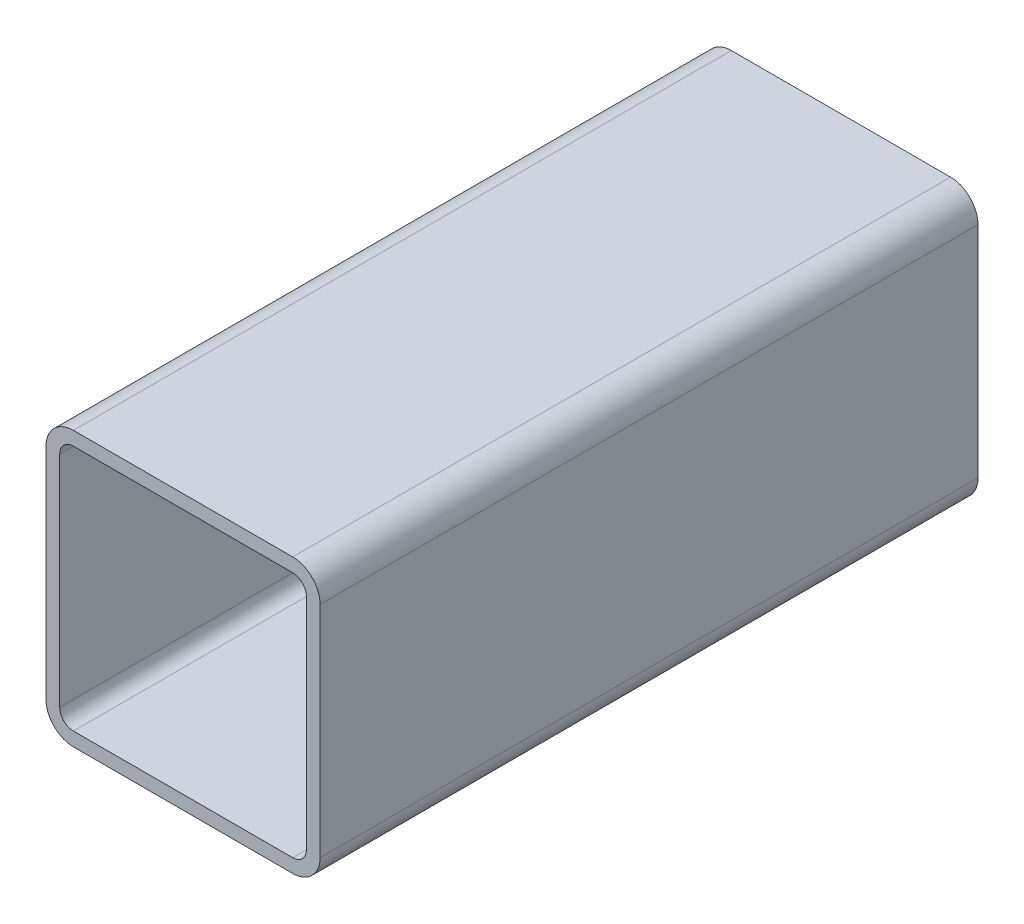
ISO-10303-21;
HEADER;
FILE_DESCRIPTION(('STEP AP214'),'2;1');
FILE_NAME('part.step','',(''),(''),'','','');
FILE_SCHEMA(('AUTOMOTIVE_DESIGN { 1 0 10303 214 1 1 1 1 }'));
ENDSEC;
DATA;
#1=APPLICATION_CONTEXT('core data for automotive mechanical design processes');
#2=APPLICATION_PROTOCOL_DEFINITION('international standard','automotive_design',2000,#1);
#3=PRODUCT_CONTEXT('',#1,'mechanical');
#4=PRODUCT('Part','Part','',(#3));
#5=PRODUCT_RELATED_PRODUCT_CATEGORY('part','',(#4));
#6=PRODUCT_DEFINITION_FORMATION('','',#4);
#7=PRODUCT_DEFINITION_CONTEXT('part definition',#1,'design');
#8=PRODUCT_DEFINITION('design','',#6,#7);
#9=PRODUCT_DEFINITION_SHAPE('','',#8);
#10=(LENGTH_UNIT() NAMED_UNIT(*) SI_UNIT(.MILLI.,.METRE.));
#11=(NAMED_UNIT(*) PLANE_ANGLE_UNIT() SI_UNIT($,.RADIAN.));
#12=(NAMED_UNIT(*) SI_UNIT($,.STERADIAN.) SOLID_ANGLE_UNIT());
#13=UNCERTAINTY_MEASURE_WITH_UNIT(LENGTH_MEASURE(1.E-05),#10,'distance_accuracy_value','');
#14=(GEOMETRIC_REPRESENTATION_CONTEXT(3) GLOBAL_UNCERTAINTY_ASSIGNED_CONTEXT((#13)) GLOBAL_UNIT_ASSIGNED_CONTEXT((#10,
#11,#12)) REPRESENTATION_CONTEXT('',''));
#15=CARTESIAN_POINT('',(0.,0.,0.));
#16=DIRECTION('',(0.,0.,1.));
#17=DIRECTION('',(1.,0.,0.));
#18=AXIS2_PLACEMENT_3D('',#15,#16,#17);
#19=CARTESIAN_POINT('',(13.5612396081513,116.33485662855,304.8));
#20=DIRECTION('',(0.,0.,1.));
#21=DIRECTION('',(1.,0.,0.));
#22=AXIS2_PLACEMENT_3D('',#19,#20,#21);
#23=PLANE('',#22);
#24=CARTESIAN_POINT('',(13.5612396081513,116.33485662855,304.8));
#25=DIRECTION('',(0.,0.,1.));
#26=DIRECTION('',(1.,0.,0.));
#27=AXIS2_PLACEMENT_3D('',#24,#25,#26);
#28=CIRCLE('',#27,12.7);
#29=CARTESIAN_POINT('',(13.5612396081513,129.03485662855,304.8));
#30=VERTEX_POINT('',#29);
#31=CARTESIAN_POINT('',(0.8612396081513,116.33485662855,304.8));
#32=VERTEX_POINT('',#31);
#33=EDGE_CURVE('E211',#30,#32,#28,.T.);
#34=ORIENTED_EDGE('',*,*,#33,.T.);
#35=DIRECTION('',(0.,-1.,0.));
#36=VECTOR('',#35,1.);
#37=CARTESIAN_POINT('',(0.8612396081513,14.73485662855,304.8));
#38=LINE('',#37,#36);
#39=CARTESIAN_POINT('',(0.8612396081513,14.73485662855,304.8));
#40=VERTEX_POINT('',#39);
#41=EDGE_CURVE('E214',#32,#40,#38,.T.);
#42=ORIENTED_EDGE('',*,*,#41,.T.);
#43=CARTESIAN_POINT('',(13.5612396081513,14.73485662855,304.8));
#44=DIRECTION('',(0.,0.,1.));
#45=DIRECTION('',(1.,0.,0.));
#46=AXIS2_PLACEMENT_3D('',#43,#44,#45);
#47=CIRCLE('',#46,12.7);
#48=CARTESIAN_POINT('',(13.5612396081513,2.03485662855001,304.8));
#49=VERTEX_POINT('',#48);
#50=EDGE_CURVE('E217',#40,#49,#47,.T.);
#51=ORIENTED_EDGE('',*,*,#50,.T.);
#52=DIRECTION('',(1.,0.,0.));
#53=VECTOR('',#52,1.);
#54=CARTESIAN_POINT('',(115.161239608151,2.03485662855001,304.8));
#55=LINE('',#54,#53);
#56=CARTESIAN_POINT('',(115.161239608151,2.03485662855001,304.8));
#57=VERTEX_POINT('',#56);
#58=EDGE_CURVE('E219',#49,#57,#55,.T.);
#59=ORIENTED_EDGE('',*,*,#58,.T.);
#60=CARTESIAN_POINT('',(115.161239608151,14.73485662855,304.8));
#61=DIRECTION('',(0.,0.,1.));
#62=DIRECTION('',(1.,0.,0.));
#63=AXIS2_PLACEMENT_3D('',#60,#61,#62);
#64=CIRCLE('',#63,12.7);
#65=CARTESIAN_POINT('',(127.861239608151,14.73485662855,304.8));
#66=VERTEX_POINT('',#65);
#67=EDGE_CURVE('E221',#57,#66,#64,.T.);
#68=ORIENTED_EDGE('',*,*,#67,.T.);
#69=DIRECTION('',(0.,1.,0.));
#70=VECTOR('',#69,1.);
#71=CARTESIAN_POINT('',(127.861239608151,116.33485662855,304.8));
#72=LINE('',#71,#70);
#73=CARTESIAN_POINT('',(127.861239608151,116.33485662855,304.8));
#74=VERTEX_POINT('',#73);
#75=EDGE_CURVE('E223',#66,#74,#72,.T.);
#76=ORIENTED_EDGE('',*,*,#75,.T.);
#77=CARTESIAN_POINT('',(115.161239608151,116.33485662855,304.8));
#78=DIRECTION('',(0.,0.,1.));
#79=DIRECTION('',(1.,0.,0.));
#80=AXIS2_PLACEMENT_3D('',#77,#78,#79);
#81=CIRCLE('',#80,12.7);
#82=CARTESIAN_POINT('',(115.161239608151,129.03485662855,304.8));
#83=VERTEX_POINT('',#82);
#84=EDGE_CURVE('E225',#74,#83,#81,.T.);
#85=ORIENTED_EDGE('',*,*,#84,.T.);
#86=DIRECTION('',(-1.,0.,0.));
#87=VECTOR('',#86,1.);
#88=CARTESIAN_POINT('',(13.5612396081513,129.03485662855,304.8));
#89=LINE('',#88,#87);
#90=EDGE_CURVE('E227',#83,#30,#89,.T.);
#91=ORIENTED_EDGE('',*,*,#90,.T.);
#92=EDGE_LOOP('',(#34,#42,#51,#59,#68,#76,#85,#91));
#93=FACE_BOUND('',#92,.T.);
#94=DIRECTION('',(0.,-1.,0.));
#95=VECTOR('',#94,1.);
#96=CARTESIAN_POINT('',(7.2112396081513,14.73485662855,304.8));
#97=LINE('',#96,#95);
#98=CARTESIAN_POINT('',(7.2112396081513,116.33485662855,304.8));
#99=VERTEX_POINT('',#98);
#100=CARTESIAN_POINT('',(7.2112396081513,14.73485662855,304.8));
#101=VERTEX_POINT('',#100);
#102=EDGE_CURVE('E154',#99,#101,#97,.T.);
#103=ORIENTED_EDGE('',*,*,#102,.F.);
#104=CARTESIAN_POINT('',(13.5612396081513,116.33485662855,304.8));
#105=DIRECTION('',(0.,0.,1.));
#106=DIRECTION('',(1.,0.,0.));
#107=AXIS2_PLACEMENT_3D('',#104,#105,#106);
#108=CIRCLE('',#107,6.35000000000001);
#109=CARTESIAN_POINT('',(13.5612396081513,122.68485662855,304.8));
#110=VERTEX_POINT('',#109);
#111=EDGE_CURVE('E146',#110,#99,#108,.T.);
#112=ORIENTED_EDGE('',*,*,#111,.F.);
#113=DIRECTION('',(-1.,0.,0.));
#114=VECTOR('',#113,1.);
#115=CARTESIAN_POINT('',(13.5612396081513,122.68485662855,304.8));
#116=LINE('',#115,#114);
#117=CARTESIAN_POINT('',(115.161239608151,122.68485662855,304.8));
#118=VERTEX_POINT('',#117);
#119=EDGE_CURVE('E179',#118,#110,#116,.T.);
#120=ORIENTED_EDGE('',*,*,#119,.F.);
#121=CARTESIAN_POINT('',(115.161239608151,116.33485662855,304.8));
#122=DIRECTION('',(0.,0.,1.));
#123=DIRECTION('',(1.,0.,0.));
#124=AXIS2_PLACEMENT_3D('',#121,#122,#123);
#125=CIRCLE('',#124,6.35000000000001);
#126=CARTESIAN_POINT('',(121.511239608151,116.33485662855,304.8));
#127=VERTEX_POINT('',#126);
#128=EDGE_CURVE('E177',#127,#118,#125,.T.);
#129=ORIENTED_EDGE('',*,*,#128,.F.);
#130=DIRECTION('',(0.,1.,0.));
#131=VECTOR('',#130,1.);
#132=CARTESIAN_POINT('',(121.511239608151,116.33485662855,304.8));
#133=LINE('',#132,#131);
#134=CARTESIAN_POINT('',(121.511239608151,14.73485662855,304.8));
#135=VERTEX_POINT('',#134);
#136=EDGE_CURVE('E175',#135,#127,#133,.T.);
#137=ORIENTED_EDGE('',*,*,#136,.F.);
#138=CARTESIAN_POINT('',(115.161239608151,14.73485662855,304.8));
#139=DIRECTION('',(0.,0.,1.));
#140=DIRECTION('',(1.,0.,0.));
#141=AXIS2_PLACEMENT_3D('',#138,#139,#140);
#142=CIRCLE('',#141,6.35000000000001);
#143=CARTESIAN_POINT('',(115.161239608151,8.38485662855,304.8));
#144=VERTEX_POINT('',#143);
#145=EDGE_CURVE('E173',#144,#135,#142,.T.);
#146=ORIENTED_EDGE('',*,*,#145,.F.);
#147=DIRECTION('',(1.,0.,0.));
#148=VECTOR('',#147,1.);
#149=CARTESIAN_POINT('',(115.161239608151,8.38485662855,304.8));
#150=LINE('',#149,#148);
#151=CARTESIAN_POINT('',(13.5612396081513,8.38485662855,304.8));
#152=VERTEX_POINT('',#151);
#153=EDGE_CURVE('E169',#152,#144,#150,.T.);
#154=ORIENTED_EDGE('',*,*,#153,.F.);
#155=CARTESIAN_POINT('',(13.5612396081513,14.73485662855,304.8));
#156=DIRECTION('',(0.,0.,1.));
#157=DIRECTION('',(1.,0.,0.));
#158=AXIS2_PLACEMENT_3D('',#155,#156,#157);
#159=CIRCLE('',#158,6.35);
#160=EDGE_CURVE('E167',#101,#152,#159,.T.);
#161=ORIENTED_EDGE('',*,*,#160,.F.);
#162=EDGE_LOOP('',(#103,#112,#120,#129,#137,#146,#154,#161));
#163=FACE_BOUND('',#162,.T.);
#164=ADVANCED_FACE('F33',(#93,#163),#23,.T.);
#165=CARTESIAN_POINT('',(13.5612396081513,116.33485662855,0.));
#166=DIRECTION('',(0.,0.,1.));
#167=DIRECTION('',(1.,0.,0.));
#168=AXIS2_PLACEMENT_3D('',#165,#166,#167);
#169=PLANE('',#168);
#170=CARTESIAN_POINT('',(13.5612396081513,116.33485662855,0.));
#171=DIRECTION('',(0.,0.,1.));
#172=DIRECTION('',(1.,0.,0.));
#173=AXIS2_PLACEMENT_3D('',#170,#171,#172);
#174=CIRCLE('',#173,12.7);
#175=CARTESIAN_POINT('',(13.5612396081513,129.03485662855,0.));
#176=VERTEX_POINT('',#175);
#177=CARTESIAN_POINT('',(0.8612396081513,116.33485662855,0.));
#178=VERTEX_POINT('',#177);
#179=EDGE_CURVE('E162',#176,#178,#174,.T.);
#180=ORIENTED_EDGE('',*,*,#179,.F.);
#181=DIRECTION('',(-1.,0.,0.));
#182=VECTOR('',#181,1.);
#183=CARTESIAN_POINT('',(13.5612396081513,129.03485662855,0.));
#184=LINE('',#183,#182);
#185=CARTESIAN_POINT('',(115.161239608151,129.03485662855,0.));
#186=VERTEX_POINT('',#185);
#187=EDGE_CURVE('E215',#186,#176,#184,.T.);
#188=ORIENTED_EDGE('',*,*,#187,.F.);
#189=CARTESIAN_POINT('',(115.161239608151,116.33485662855,0.));
#190=DIRECTION('',(0.,0.,1.));
#191=DIRECTION('',(1.,0.,0.));
#192=AXIS2_PLACEMENT_3D('',#189,#190,#191);
#193=CIRCLE('',#192,12.7);
#194=CARTESIAN_POINT('',(127.861239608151,116.33485662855,0.));
#195=VERTEX_POINT('',#194);
#196=EDGE_CURVE('E242',#195,#186,#193,.T.);
#197=ORIENTED_EDGE('',*,*,#196,.F.);
#198=DIRECTION('',(0.,1.,0.));
#199=VECTOR('',#198,1.);
#200=CARTESIAN_POINT('',(127.861239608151,116.33485662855,0.));
#201=LINE('',#200,#199);
#202=CARTESIAN_POINT('',(127.861239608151,14.73485662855,0.));
#203=VERTEX_POINT('',#202);
#204=EDGE_CURVE('E240',#203,#195,#201,.T.);
#205=ORIENTED_EDGE('',*,*,#204,.F.);
#206=CARTESIAN_POINT('',(115.161239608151,14.73485662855,0.));
#207=DIRECTION('',(0.,0.,1.));
#208=DIRECTION('',(1.,0.,0.));
#209=AXIS2_PLACEMENT_3D('',#206,#207,#208);
#210=CIRCLE('',#209,12.7);
#211=CARTESIAN_POINT('',(115.161239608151,2.03485662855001,0.));
#212=VERTEX_POINT('',#211);
#213=EDGE_CURVE('E238',#212,#203,#210,.T.);
#214=ORIENTED_EDGE('',*,*,#213,.F.);
#215=DIRECTION('',(1.,0.,0.));
#216=VECTOR('',#215,1.);
#217=CARTESIAN_POINT('',(115.161239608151,2.03485662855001,0.));
#218=LINE('',#217,#216);
#219=CARTESIAN_POINT('',(13.5612396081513,2.03485662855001,0.));
#220=VERTEX_POINT('',#219);
#221=EDGE_CURVE('E236',#220,#212,#218,.T.);
#222=ORIENTED_EDGE('',*,*,#221,.F.);
#223=CARTESIAN_POINT('',(13.5612396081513,14.73485662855,0.));
#224=DIRECTION('',(0.,0.,1.));
#225=DIRECTION('',(1.,0.,0.));
#226=AXIS2_PLACEMENT_3D('',#223,#224,#225);
#227=CIRCLE('',#226,12.7);
#228=CARTESIAN_POINT('',(0.8612396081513,14.73485662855,0.));
#229=VERTEX_POINT('',#228);
#230=EDGE_CURVE('E234',#229,#220,#227,.T.);
#231=ORIENTED_EDGE('',*,*,#230,.F.);
#232=DIRECTION('',(0.,-1.,0.));
#233=VECTOR('',#232,1.);
#234=CARTESIAN_POINT('',(0.8612396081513,14.73485662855,0.));
#235=LINE('',#234,#233);
#236=EDGE_CURVE('E232',#178,#229,#235,.T.);
#237=ORIENTED_EDGE('',*,*,#236,.F.);
#238=EDGE_LOOP('',(#180,#188,#197,#205,#214,#222,#231,#237));
#239=FACE_BOUND('',#238,.T.);
#240=CARTESIAN_POINT('',(13.5612396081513,116.33485662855,0.));
#241=DIRECTION('',(0.,0.,1.));
#242=DIRECTION('',(1.,0.,0.));
#243=AXIS2_PLACEMENT_3D('',#240,#241,#242);
#244=CIRCLE('',#243,6.35000000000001);
#245=CARTESIAN_POINT('',(13.5612396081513,122.68485662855,0.));
#246=VERTEX_POINT('',#245);
#247=CARTESIAN_POINT('',(7.2112396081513,116.33485662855,0.));
#248=VERTEX_POINT('',#247);
#249=EDGE_CURVE('E56',#246,#248,#244,.T.);
#250=ORIENTED_EDGE('',*,*,#249,.T.);
#251=DIRECTION('',(0.,-1.,0.));
#252=VECTOR('',#251,1.);
#253=CARTESIAN_POINT('',(7.2112396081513,14.73485662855,0.));
#254=LINE('',#253,#252);
#255=CARTESIAN_POINT('',(7.2112396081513,14.73485662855,0.));
#256=VERTEX_POINT('',#255);
#257=EDGE_CURVE('E161',#248,#256,#254,.T.);
#258=ORIENTED_EDGE('',*,*,#257,.T.);
#259=CARTESIAN_POINT('',(13.5612396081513,14.73485662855,0.));
#260=DIRECTION('',(0.,0.,1.));
#261=DIRECTION('',(1.,0.,0.));
#262=AXIS2_PLACEMENT_3D('',#259,#260,#261);
#263=CIRCLE('',#262,6.35);
#264=CARTESIAN_POINT('',(13.5612396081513,8.38485662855,0.));
#265=VERTEX_POINT('',#264);
#266=EDGE_CURVE('E183',#256,#265,#263,.T.);
#267=ORIENTED_EDGE('',*,*,#266,.T.);
#268=DIRECTION('',(1.,0.,0.));
#269=VECTOR('',#268,1.);
#270=CARTESIAN_POINT('',(115.161239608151,8.38485662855,0.));
#271=LINE('',#270,#269);
#272=CARTESIAN_POINT('',(115.161239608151,8.38485662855,0.));
#273=VERTEX_POINT('',#272);
#274=EDGE_CURVE('E186',#265,#273,#271,.T.);
#275=ORIENTED_EDGE('',*,*,#274,.T.);
#276=CARTESIAN_POINT('',(115.161239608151,14.73485662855,0.));
#277=DIRECTION('',(0.,0.,1.));
#278=DIRECTION('',(1.,0.,0.));
#279=AXIS2_PLACEMENT_3D('',#276,#277,#278);
#280=CIRCLE('',#279,6.35000000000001);
#281=CARTESIAN_POINT('',(121.511239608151,14.73485662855,0.));
#282=VERTEX_POINT('',#281);
#283=EDGE_CURVE('E189',#273,#282,#280,.T.);
#284=ORIENTED_EDGE('',*,*,#283,.T.);
#285=DIRECTION('',(0.,1.,0.));
#286=VECTOR('',#285,1.);
#287=CARTESIAN_POINT('',(121.511239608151,116.33485662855,0.));
#288=LINE('',#287,#286);
#289=CARTESIAN_POINT('',(121.511239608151,116.33485662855,0.));
#290=VERTEX_POINT('',#289);
#291=EDGE_CURVE('E192',#282,#290,#288,.T.);
#292=ORIENTED_EDGE('',*,*,#291,.T.);
#293=CARTESIAN_POINT('',(115.161239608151,116.33485662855,0.));
#294=DIRECTION('',(0.,0.,1.));
#295=DIRECTION('',(1.,0.,0.));
#296=AXIS2_PLACEMENT_3D('',#293,#294,#295);
#297=CIRCLE('',#296,6.35000000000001);
#298=CARTESIAN_POINT('',(115.161239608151,122.68485662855,0.));
#299=VERTEX_POINT('',#298);
#300=EDGE_CURVE('E195',#290,#299,#297,.T.);
#301=ORIENTED_EDGE('',*,*,#300,.T.);
#302=DIRECTION('',(-1.,0.,0.));
#303=VECTOR('',#302,1.);
#304=CARTESIAN_POINT('',(13.5612396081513,122.68485662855,0.));
#305=LINE('',#304,#303);
#306=EDGE_CURVE('E155',#299,#246,#305,.T.);
#307=ORIENTED_EDGE('',*,*,#306,.T.);
#308=EDGE_LOOP('',(#250,#258,#267,#275,#284,#292,#301,#307));
#309=FACE_BOUND('',#308,.T.);
#310=ADVANCED_FACE('F272',(#239,#309),#169,.F.);
#311=CARTESIAN_POINT('',(13.5612396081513,116.33485662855,304.8));
#312=DIRECTION('',(0.,0.,-1.));
#313=DIRECTION('',(-1.,0.,0.));
#314=AXIS2_PLACEMENT_3D('',#311,#312,#313);
#315=CYLINDRICAL_SURFACE('',#314,12.7);
#316=ORIENTED_EDGE('',*,*,#179,.T.);
#317=DIRECTION('',(0.,0.,-1.));
#318=VECTOR('',#317,1.);
#319=CARTESIAN_POINT('',(0.8612396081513,116.33485662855,304.8));
#320=LINE('',#319,#318);
#321=EDGE_CURVE('E11',#32,#178,#320,.T.);
#322=ORIENTED_EDGE('',*,*,#321,.F.);
#323=ORIENTED_EDGE('',*,*,#33,.F.);
#324=DIRECTION('',(0.,0.,-1.));
#325=VECTOR('',#324,1.);
#326=CARTESIAN_POINT('',(13.5612396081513,129.03485662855,304.8));
#327=LINE('',#326,#325);
#328=EDGE_CURVE('E229',#30,#176,#327,.T.);
#329=ORIENTED_EDGE('',*,*,#328,.T.);
#330=EDGE_LOOP('',(#316,#322,#323,#329));
#331=FACE_BOUND('',#330,.T.);
#332=ADVANCED_FACE('F35',(#331),#315,.T.);
#333=CARTESIAN_POINT('',(0.8612396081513,14.73485662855,304.8));
#334=DIRECTION('',(1.,0.,0.));
#335=DIRECTION('',(0.,0.,-1.));
#336=AXIS2_PLACEMENT_3D('',#333,#334,#335);
#337=PLANE('',#336);
#338=ORIENTED_EDGE('',*,*,#236,.T.);
#339=DIRECTION('',(0.,0.,-1.));
#340=VECTOR('',#339,1.);
#341=CARTESIAN_POINT('',(0.8612396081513,14.73485662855,304.8));
#342=LINE('',#341,#340);
#343=EDGE_CURVE('E41',#40,#229,#342,.T.);
#344=ORIENTED_EDGE('',*,*,#343,.F.);
#345=ORIENTED_EDGE('',*,*,#41,.F.);
#346=ORIENTED_EDGE('',*,*,#321,.T.);
#347=EDGE_LOOP('',(#338,#344,#345,#346));
#348=FACE_BOUND('',#347,.T.);
#349=ADVANCED_FACE('F289',(#348),#337,.F.);
#350=CARTESIAN_POINT('',(13.5612396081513,14.73485662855,304.8));
#351=DIRECTION('',(0.,0.,-1.));
#352=DIRECTION('',(-1.,0.,0.));
#353=AXIS2_PLACEMENT_3D('',#350,#351,#352);
#354=CYLINDRICAL_SURFACE('',#353,12.7);
#355=ORIENTED_EDGE('',*,*,#230,.T.);
#356=DIRECTION('',(0.,0.,-1.));
#357=VECTOR('',#356,1.);
#358=CARTESIAN_POINT('',(13.5612396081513,2.03485662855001,304.8));
#359=LINE('',#358,#357);
#360=EDGE_CURVE('E259',#49,#220,#359,.T.);
#361=ORIENTED_EDGE('',*,*,#360,.F.);
#362=ORIENTED_EDGE('',*,*,#50,.F.);
#363=ORIENTED_EDGE('',*,*,#343,.T.);
#364=EDGE_LOOP('',(#355,#361,#362,#363));
#365=FACE_BOUND('',#364,.T.);
#366=ADVANCED_FACE('F266',(#365),#354,.T.);
#367=CARTESIAN_POINT('',(115.161239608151,2.03485662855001,304.8));
#368=DIRECTION('',(0.,1.,0.));
#369=DIRECTION('',(0.,0.,1.));
#370=AXIS2_PLACEMENT_3D('',#367,#368,#369);
#371=PLANE('',#370);
#372=ORIENTED_EDGE('',*,*,#221,.T.);
#373=DIRECTION('',(0.,0.,-1.));
#374=VECTOR('',#373,1.);
#375=CARTESIAN_POINT('',(115.161239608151,2.03485662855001,304.8));
#376=LINE('',#375,#374);
#377=EDGE_CURVE('E256',#57,#212,#376,.T.);
#378=ORIENTED_EDGE('',*,*,#377,.F.);
#379=ORIENTED_EDGE('',*,*,#58,.F.);
#380=ORIENTED_EDGE('',*,*,#360,.T.);
#381=EDGE_LOOP('',(#372,#378,#379,#380));
#382=FACE_BOUND('',#381,.T.);
#383=ADVANCED_FACE('F278',(#382),#371,.F.);
#384=CARTESIAN_POINT('',(115.161239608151,14.73485662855,304.8));
#385=DIRECTION('',(0.,0.,-1.));
#386=DIRECTION('',(-1.,0.,0.));
#387=AXIS2_PLACEMENT_3D('',#384,#385,#386);
#388=CYLINDRICAL_SURFACE('',#387,12.7);
#389=ORIENTED_EDGE('',*,*,#213,.T.);
#390=DIRECTION('',(0.,0.,-1.));
#391=VECTOR('',#390,1.);
#392=CARTESIAN_POINT('',(127.861239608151,14.73485662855,304.8));
#393=LINE('',#392,#391);
#394=EDGE_CURVE('E253',#66,#203,#393,.T.);
#395=ORIENTED_EDGE('',*,*,#394,.F.);
#396=ORIENTED_EDGE('',*,*,#67,.F.);
#397=ORIENTED_EDGE('',*,*,#377,.T.);
#398=EDGE_LOOP('',(#389,#395,#396,#397));
#399=FACE_BOUND('',#398,.T.);
#400=ADVANCED_FACE('F282',(#399),#388,.T.);
#401=CARTESIAN_POINT('',(127.861239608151,116.33485662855,304.8));
#402=DIRECTION('',(-1.,0.,0.));
#403=DIRECTION('',(0.,0.,1.));
#404=AXIS2_PLACEMENT_3D('',#401,#402,#403);
#405=PLANE('',#404);
#406=ORIENTED_EDGE('',*,*,#204,.T.);
#407=DIRECTION('',(0.,0.,-1.));
#408=VECTOR('',#407,1.);
#409=CARTESIAN_POINT('',(127.861239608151,116.33485662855,304.8));
#410=LINE('',#409,#408);
#411=EDGE_CURVE('E250',#74,#195,#410,.T.);
#412=ORIENTED_EDGE('',*,*,#411,.F.);
#413=ORIENTED_EDGE('',*,*,#75,.F.);
#414=ORIENTED_EDGE('',*,*,#394,.T.);
#415=EDGE_LOOP('',(#406,#412,#413,#414));
#416=FACE_BOUND('',#415,.T.);
#417=ADVANCED_FACE('F302',(#416),#405,.F.);
#418=CARTESIAN_POINT('',(115.161239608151,116.33485662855,304.8));
#419=DIRECTION('',(0.,0.,-1.));
#420=DIRECTION('',(-1.,0.,0.));
#421=AXIS2_PLACEMENT_3D('',#418,#419,#420);
#422=CYLINDRICAL_SURFACE('',#421,12.7);
#423=ORIENTED_EDGE('',*,*,#196,.T.);
#424=DIRECTION('',(0.,0.,-1.));
#425=VECTOR('',#424,1.);
#426=CARTESIAN_POINT('',(115.161239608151,129.03485662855,304.8));
#427=LINE('',#426,#425);
#428=EDGE_CURVE('E247',#83,#186,#427,.T.);
#429=ORIENTED_EDGE('',*,*,#428,.F.);
#430=ORIENTED_EDGE('',*,*,#84,.F.);
#431=ORIENTED_EDGE('',*,*,#411,.T.);
#432=EDGE_LOOP('',(#423,#429,#430,#431));
#433=FACE_BOUND('',#432,.T.);
#434=ADVANCED_FACE('F300',(#433),#422,.T.);
#435=CARTESIAN_POINT('',(13.5612396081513,129.03485662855,304.8));
#436=DIRECTION('',(0.,-1.,0.));
#437=DIRECTION('',(0.,0.,-1.));
#438=AXIS2_PLACEMENT_3D('',#435,#436,#437);
#439=PLANE('',#438);
#440=ORIENTED_EDGE('',*,*,#187,.T.);
#441=ORIENTED_EDGE('',*,*,#328,.F.);
#442=ORIENTED_EDGE('',*,*,#90,.F.);
#443=ORIENTED_EDGE('',*,*,#428,.T.);
#444=EDGE_LOOP('',(#440,#441,#442,#443));
#445=FACE_BOUND('',#444,.T.);
#446=ADVANCED_FACE('F295',(#445),#439,.F.);
#447=CARTESIAN_POINT('',(13.5612396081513,116.33485662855,304.8));
#448=DIRECTION('',(0.,0.,-1.));
#449=DIRECTION('',(-1.,0.,0.));
#450=AXIS2_PLACEMENT_3D('',#447,#448,#449);
#451=CYLINDRICAL_SURFACE('',#450,6.35000000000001);
#452=ORIENTED_EDGE('',*,*,#249,.F.);
#453=DIRECTION('',(0.,0.,-1.));
#454=VECTOR('',#453,1.);
#455=CARTESIAN_POINT('',(13.5612396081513,122.68485662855,304.8));
#456=LINE('',#455,#454);
#457=EDGE_CURVE('E150',#110,#246,#456,.T.);
#458=ORIENTED_EDGE('',*,*,#457,.F.);
#459=ORIENTED_EDGE('',*,*,#111,.T.);
#460=DIRECTION('',(0.,0.,-1.));
#461=VECTOR('',#460,1.);
#462=CARTESIAN_POINT('',(7.2112396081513,116.33485662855,304.8));
#463=LINE('',#462,#461);
#464=EDGE_CURVE('E149',#99,#248,#463,.T.);
#465=ORIENTED_EDGE('',*,*,#464,.T.);
#466=EDGE_LOOP('',(#452,#458,#459,#465));
#467=FACE_BOUND('',#466,.T.);
#468=ADVANCED_FACE('F148',(#467),#451,.F.);
#469=CARTESIAN_POINT('',(7.2112396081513,14.73485662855,304.8));
#470=DIRECTION('',(1.,0.,0.));
#471=DIRECTION('',(0.,0.,-1.));
#472=AXIS2_PLACEMENT_3D('',#469,#470,#471);
#473=PLANE('',#472);
#474=ORIENTED_EDGE('',*,*,#257,.F.);
#475=ORIENTED_EDGE('',*,*,#464,.F.);
#476=ORIENTED_EDGE('',*,*,#102,.T.);
#477=DIRECTION('',(0.,0.,-1.));
#478=VECTOR('',#477,1.);
#479=CARTESIAN_POINT('',(7.2112396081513,14.73485662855,304.8));
#480=LINE('',#479,#478);
#481=EDGE_CURVE('E163',#101,#256,#480,.T.);
#482=ORIENTED_EDGE('',*,*,#481,.T.);
#483=EDGE_LOOP('',(#474,#475,#476,#482));
#484=FACE_BOUND('',#483,.T.);
#485=ADVANCED_FACE('F158',(#484),#473,.T.);
#486=CARTESIAN_POINT('',(13.5612396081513,14.73485662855,304.8));
#487=DIRECTION('',(0.,0.,-1.));
#488=DIRECTION('',(-1.,0.,0.));
#489=AXIS2_PLACEMENT_3D('',#486,#487,#488);
#490=CYLINDRICAL_SURFACE('',#489,6.35);
#491=ORIENTED_EDGE('',*,*,#266,.F.);
#492=ORIENTED_EDGE('',*,*,#481,.F.);
#493=ORIENTED_EDGE('',*,*,#160,.T.);
#494=DIRECTION('',(0.,0.,-1.));
#495=VECTOR('',#494,1.);
#496=CARTESIAN_POINT('',(13.5612396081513,8.38485662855,304.8));
#497=LINE('',#496,#495);
#498=EDGE_CURVE('E208',#152,#265,#497,.T.);
#499=ORIENTED_EDGE('',*,*,#498,.T.);
#500=EDGE_LOOP('',(#491,#492,#493,#499));
#501=FACE_BOUND('',#500,.T.);
#502=ADVANCED_FACE('F327',(#501),#490,.F.);
#503=CARTESIAN_POINT('',(115.161239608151,8.38485662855,304.8));
#504=DIRECTION('',(0.,1.,0.));
#505=DIRECTION('',(0.,0.,1.));
#506=AXIS2_PLACEMENT_3D('',#503,#504,#505);
#507=PLANE('',#506);
#508=ORIENTED_EDGE('',*,*,#274,.F.);
#509=ORIENTED_EDGE('',*,*,#498,.F.);
#510=ORIENTED_EDGE('',*,*,#153,.T.);
#511=DIRECTION('',(0.,0.,-1.));
#512=VECTOR('',#511,1.);
#513=CARTESIAN_POINT('',(115.161239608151,8.38485662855,304.8));
#514=LINE('',#513,#512);
#515=EDGE_CURVE('E206',#144,#273,#514,.T.);
#516=ORIENTED_EDGE('',*,*,#515,.T.);
#517=EDGE_LOOP('',(#508,#509,#510,#516));
#518=FACE_BOUND('',#517,.T.);
#519=ADVANCED_FACE('F331',(#518),#507,.T.);
#520=CARTESIAN_POINT('',(115.161239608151,14.73485662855,304.8));
#521=DIRECTION('',(0.,0.,-1.));
#522=DIRECTION('',(-1.,0.,0.));
#523=AXIS2_PLACEMENT_3D('',#520,#521,#522);
#524=CYLINDRICAL_SURFACE('',#523,6.35000000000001);
#525=ORIENTED_EDGE('',*,*,#283,.F.);
#526=ORIENTED_EDGE('',*,*,#515,.F.);
#527=ORIENTED_EDGE('',*,*,#145,.T.);
#528=DIRECTION('',(0.,0.,-1.));
#529=VECTOR('',#528,1.);
#530=CARTESIAN_POINT('',(121.511239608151,14.73485662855,304.8));
#531=LINE('',#530,#529);
#532=EDGE_CURVE('E204',#135,#282,#531,.T.);
#533=ORIENTED_EDGE('',*,*,#532,.T.);
#534=EDGE_LOOP('',(#525,#526,#527,#533));
#535=FACE_BOUND('',#534,.T.);
#536=ADVANCED_FACE('F337',(#535),#524,.F.);
#537=CARTESIAN_POINT('',(121.511239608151,116.33485662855,304.8));
#538=DIRECTION('',(-1.,0.,0.));
#539=DIRECTION('',(0.,0.,1.));
#540=AXIS2_PLACEMENT_3D('',#537,#538,#539);
#541=PLANE('',#540);
#542=ORIENTED_EDGE('',*,*,#291,.F.);
#543=ORIENTED_EDGE('',*,*,#532,.F.);
#544=ORIENTED_EDGE('',*,*,#136,.T.);
#545=DIRECTION('',(0.,0.,-1.));
#546=VECTOR('',#545,1.);
#547=CARTESIAN_POINT('',(121.511239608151,116.33485662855,304.8));
#548=LINE('',#547,#546);
#549=EDGE_CURVE('E202',#127,#290,#548,.T.);
#550=ORIENTED_EDGE('',*,*,#549,.T.);
#551=EDGE_LOOP('',(#542,#543,#544,#550));
#552=FACE_BOUND('',#551,.T.);
#553=ADVANCED_FACE('F341',(#552),#541,.T.);
#554=CARTESIAN_POINT('',(115.161239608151,116.33485662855,304.8));
#555=DIRECTION('',(0.,0.,-1.));
#556=DIRECTION('',(-1.,0.,0.));
#557=AXIS2_PLACEMENT_3D('',#554,#555,#556);
#558=CYLINDRICAL_SURFACE('',#557,6.35000000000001);
#559=ORIENTED_EDGE('',*,*,#300,.F.);
#560=ORIENTED_EDGE('',*,*,#549,.F.);
#561=ORIENTED_EDGE('',*,*,#128,.T.);
#562=DIRECTION('',(0.,0.,-1.));
#563=VECTOR('',#562,1.);
#564=CARTESIAN_POINT('',(115.161239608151,122.68485662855,304.8));
#565=LINE('',#564,#563);
#566=EDGE_CURVE('E48',#118,#299,#565,.T.);
#567=ORIENTED_EDGE('',*,*,#566,.T.);
#568=EDGE_LOOP('',(#559,#560,#561,#567));
#569=FACE_BOUND('',#568,.T.);
#570=ADVANCED_FACE('F345',(#569),#558,.F.);
#571=CARTESIAN_POINT('',(13.5612396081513,122.68485662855,304.8));
#572=DIRECTION('',(0.,-1.,0.));
#573=DIRECTION('',(0.,0.,-1.));
#574=AXIS2_PLACEMENT_3D('',#571,#572,#573);
#575=PLANE('',#574);
#576=ORIENTED_EDGE('',*,*,#306,.F.);
#577=ORIENTED_EDGE('',*,*,#566,.F.);
#578=ORIENTED_EDGE('',*,*,#119,.T.);
#579=ORIENTED_EDGE('',*,*,#457,.T.);
#580=EDGE_LOOP('',(#576,#577,#578,#579));
#581=FACE_BOUND('',#580,.T.);
#582=ADVANCED_FACE('F349',(#581),#575,.T.);
#583=CLOSED_SHELL('',(#164,#310,#332,#349,#366,#383,#400,#417,#434,#446,#468,#485,#502,#519,
#536,#553,#570,#582));
#584=MANIFOLD_SOLID_BREP('B2',#583);
#585=ADVANCED_BREP_SHAPE_REPRESENTATION('',(#18,#584),#14);
#586=SHAPE_DEFINITION_REPRESENTATION(#9,#585);
ENDSEC;
END-ISO-10303-21;
